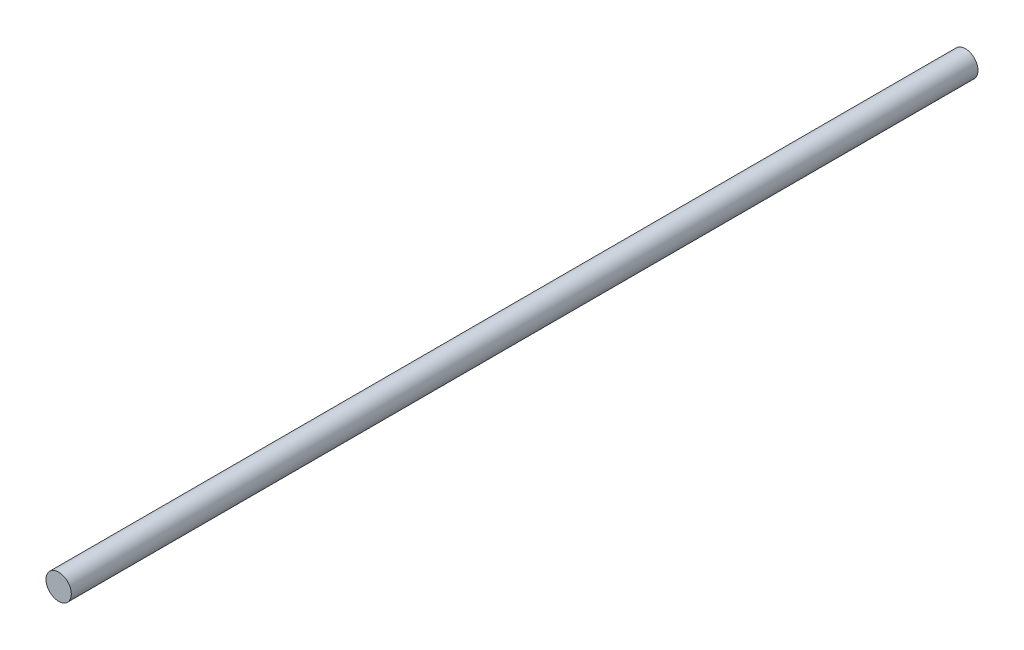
from build123d import *

# Parameters (mm, degrees)
SKETCH2_R           = 0.9779
BOSS_EXTRUDE1_DEPTH = 70.0024


with BuildPart() as part:
    # Sketch2 → Boss-Extrude1 (new body)
    with BuildSketch(Plane.XY):
        Circle(SKETCH2_R)
    extrude(amount=BOSS_EXTRUDE1_DEPTH)


solid = part.part
